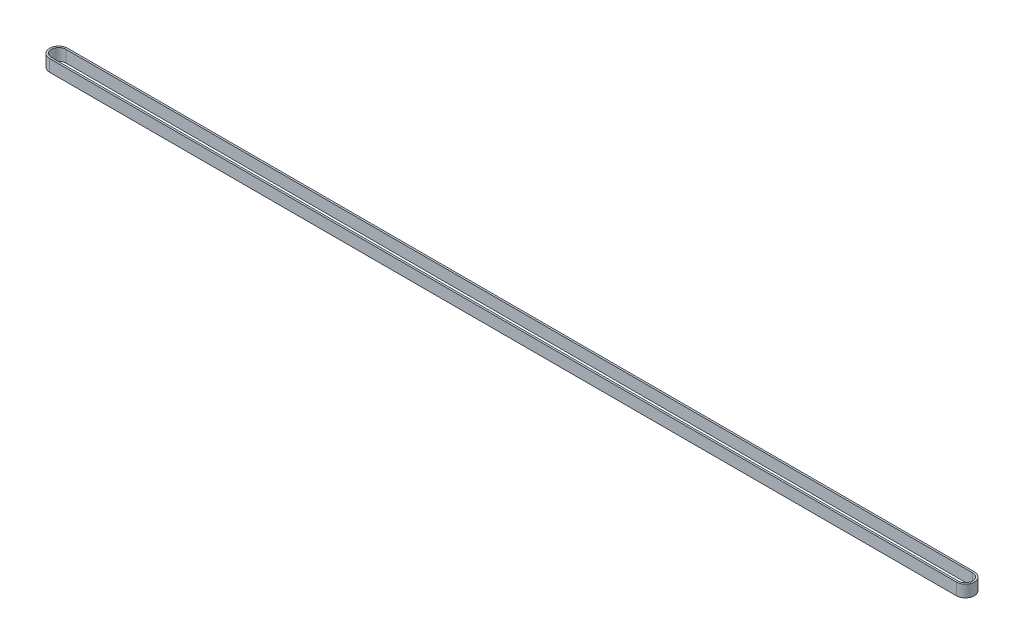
from build123d import *

# Parameters (mm, degrees)
AUFSATZ_LINEAR_AUSTRAGEN1_DEPTH = 5


with BuildPart() as part:
    # Skizze1 → Aufsatz-Linear austragen1 (new, symmetric)
    with BuildSketch(Plane(origin=(0, 0, 0), x_dir=(1, 0, 0), z_dir=(0, 1, 0))):
        with BuildLine():
            Line((758.8, -7.5), (0, -7.5))
            ThreePointArc((0, -7.5), (-7.5, 0), (0, 7.5))
            Line((0, 7.5), (758.8, 7.5))
            ThreePointArc((758.8, 7.5), (766.3, 0), (758.8, -7.5))
        make_face()
        with BuildLine():
            Line((758.8, -6), (0, -6))
            ThreePointArc((0, -6), (-6, 0), (0, 6))
            Line((0, 6), (758.8, 6))
            ThreePointArc((758.8, 6), (764.8, 0), (758.8, -6))
        make_face(mode=Mode.SUBTRACT)
    extrude(amount=AUFSATZ_LINEAR_AUSTRAGEN1_DEPTH, both=True)


solid = part.part
